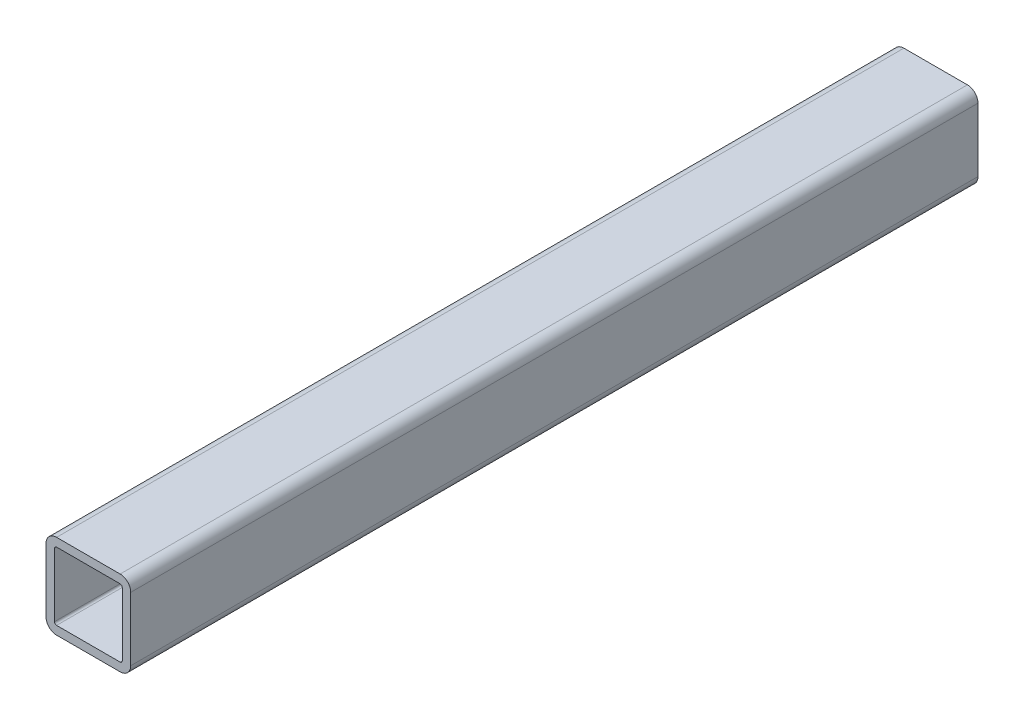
from build123d import *

# Parameters (mm, degrees)
BASE_EXTRUSION_DEPTH = 400


with BuildPart() as part:
    # Esquisse1 → Base-Extrusion (new body)
    with BuildSketch(Plane.XY):
        with BuildLine():
            Line((5, 0), (35, 0))
            ThreePointArc((35, 0), (38.535533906, -1.464466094), (40, -5))
            Line((40, -5), (40, -35))
            ThreePointArc((40, -35), (38.535533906, -38.535533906), (35, -40))
            Line((35, -40), (5, -40))
            ThreePointArc((5, -40), (1.464466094, -38.535533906), (0, -35))
            Line((0, -35), (0, -5))
            ThreePointArc((0, -5), (1.464466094, -1.464466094), (5, 0))
        make_face()
        with BuildLine():
            Line((5, -4), (35, -4))
            ThreePointArc((35, -4), (35.707106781, -4.292893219), (36, -5))
            Line((36, -5), (36, -35))
            ThreePointArc((36, -35), (35.707106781, -35.707106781), (35, -36))
            Line((35, -36), (5, -36))
            ThreePointArc((5, -36), (4.292893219, -35.707106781), (4, -35))
            Line((4, -35), (4, -5))
            ThreePointArc((4, -5), (4.292893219, -4.292893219), (5, -4))
        make_face(mode=Mode.SUBTRACT)
    extrude(amount=BASE_EXTRUSION_DEPTH)


solid = part.part
